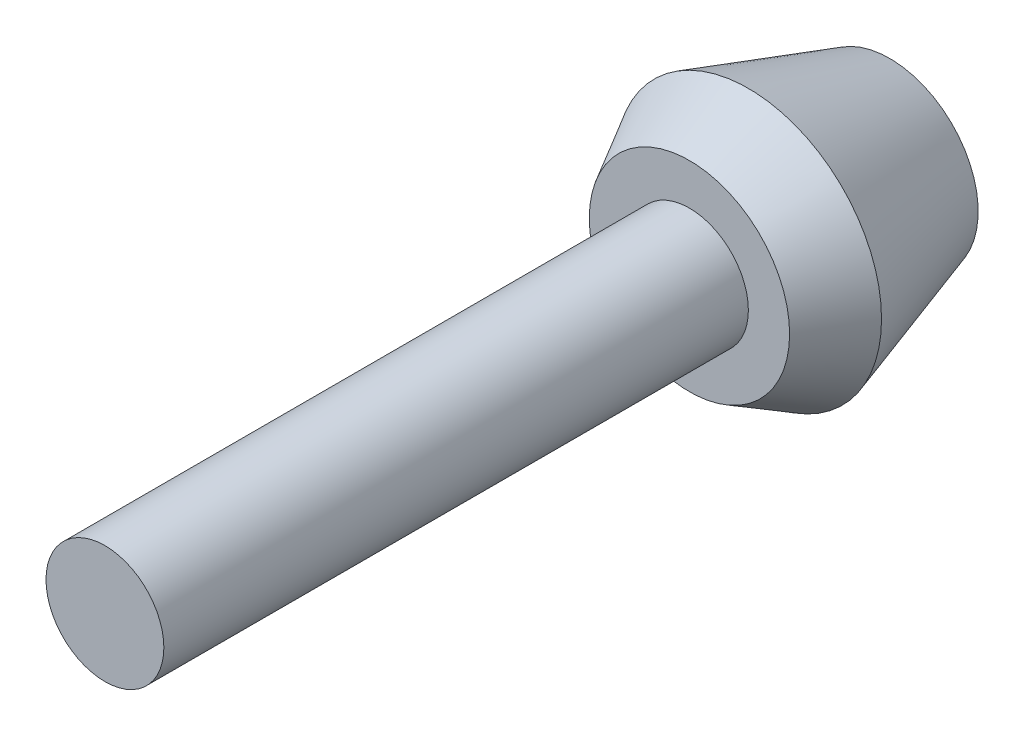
ISO-10303-21;
HEADER;
FILE_DESCRIPTION(('STEP AP214'),'2;1');
FILE_NAME('part.step','',(''),(''),'','','');
FILE_SCHEMA(('AUTOMOTIVE_DESIGN { 1 0 10303 214 1 1 1 1 }'));
ENDSEC;
DATA;
#1=APPLICATION_CONTEXT('core data for automotive mechanical design processes');
#2=APPLICATION_PROTOCOL_DEFINITION('international standard','automotive_design',2000,#1);
#3=PRODUCT_CONTEXT('',#1,'mechanical');
#4=PRODUCT('Part','Part','',(#3));
#5=PRODUCT_RELATED_PRODUCT_CATEGORY('part','',(#4));
#6=PRODUCT_DEFINITION_FORMATION('','',#4);
#7=PRODUCT_DEFINITION_CONTEXT('part definition',#1,'design');
#8=PRODUCT_DEFINITION('design','',#6,#7);
#9=PRODUCT_DEFINITION_SHAPE('','',#8);
#10=(LENGTH_UNIT() NAMED_UNIT(*) SI_UNIT(.MILLI.,.METRE.));
#11=(NAMED_UNIT(*) PLANE_ANGLE_UNIT() SI_UNIT($,.RADIAN.));
#12=(NAMED_UNIT(*) SI_UNIT($,.STERADIAN.) SOLID_ANGLE_UNIT());
#13=UNCERTAINTY_MEASURE_WITH_UNIT(LENGTH_MEASURE(1.E-05),#10,'distance_accuracy_value','');
#14=(GEOMETRIC_REPRESENTATION_CONTEXT(3) GLOBAL_UNCERTAINTY_ASSIGNED_CONTEXT((#13)) GLOBAL_UNIT_ASSIGNED_CONTEXT((#10,
#11,#12)) REPRESENTATION_CONTEXT('',''));
#15=CARTESIAN_POINT('',(0.,0.,0.));
#16=DIRECTION('',(0.,0.,1.));
#17=DIRECTION('',(1.,0.,0.));
#18=AXIS2_PLACEMENT_3D('',#15,#16,#17);
#19=CARTESIAN_POINT('',(0.,0.,0.));
#20=DIRECTION('',(0.,0.,-1.));
#21=DIRECTION('',(-1.,2.23741544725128E-13,0.));
#22=AXIS2_PLACEMENT_3D('',#19,#20,#21);
#23=PLANE('',#22);
#24=CARTESIAN_POINT('',(0.,0.,0.));
#25=DIRECTION('',(0.,0.,-1.));
#26=DIRECTION('',(-1.,0.,0.));
#27=AXIS2_PLACEMENT_3D('',#24,#25,#26);
#28=CIRCLE('',#27,3.75000000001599);
#29=CARTESIAN_POINT('',(-3.75000000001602,0.,0.));
#30=VERTEX_POINT('',#29);
#31=EDGE_CURVE('E33',#30,#30,#28,.F.);
#32=ORIENTED_EDGE('',*,*,#31,.F.);
#33=EDGE_LOOP('',(#32));
#34=FACE_BOUND('',#33,.T.);
#35=ADVANCED_FACE('F15',(#34),#23,.T.);
#36=CARTESIAN_POINT('',(0.,0.,5.79362678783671));
#37=DIRECTION('',(0.,0.,1.));
#38=DIRECTION('',(1.,-2.23741544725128E-13,0.));
#39=AXIS2_PLACEMENT_3D('',#36,#37,#38);
#40=CONICAL_SURFACE('',#39,5.58464848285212,0.306676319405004);
#41=ORIENTED_EDGE('',*,*,#31,.T.);
#42=EDGE_LOOP('',(#41));
#43=FACE_BOUND('',#42,.T.);
#44=CARTESIAN_POINT('',(0.,0.,5.99999999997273));
#45=DIRECTION('',(0.,0.,-1.));
#46=DIRECTION('',(-1.,0.,0.));
#47=AXIS2_PLACEMENT_3D('',#44,#45,#46);
#48=CIRCLE('',#47,5.65000000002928);
#49=CARTESIAN_POINT('',(-5.65000000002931,0.,5.99999999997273));
#50=VERTEX_POINT('',#49);
#51=EDGE_CURVE('E22',#50,#50,#48,.T.);
#52=ORIENTED_EDGE('',*,*,#51,.T.);
#53=EDGE_LOOP('',(#52));
#54=FACE_BOUND('',#53,.T.);
#55=ADVANCED_FACE('F54',(#43,#54),#40,.T.);
#56=CARTESIAN_POINT('',(0.,0.,6.18887432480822));
#57=DIRECTION('',(0.,0.,-1.));
#58=DIRECTION('',(-1.,2.23741544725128E-13,0.));
#59=AXIS2_PLACEMENT_3D('',#56,#57,#58);
#60=CONICAL_SURFACE('',#59,5.54423037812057,0.510488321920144);
#61=CARTESIAN_POINT('',(0.,0.,8.5));
#62=DIRECTION('',(0.,0.,-1.));
#63=DIRECTION('',(-1.,0.,0.));
#64=AXIS2_PLACEMENT_3D('',#61,#62,#63);
#65=CIRCLE('',#64,4.25000000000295);
#66=CARTESIAN_POINT('',(-4.25000000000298,0.,8.5));
#67=VERTEX_POINT('',#66);
#68=EDGE_CURVE('E10',#67,#67,#65,.F.);
#69=ORIENTED_EDGE('',*,*,#68,.F.);
#70=EDGE_LOOP('',(#69));
#71=FACE_BOUND('',#70,.T.);
#72=ORIENTED_EDGE('',*,*,#51,.F.);
#73=EDGE_LOOP('',(#72));
#74=FACE_BOUND('',#73,.T.);
#75=ADVANCED_FACE('F17',(#71,#74),#60,.T.);
#76=CARTESIAN_POINT('',(0.,0.,33.3));
#77=DIRECTION('',(0.,0.,-1.));
#78=DIRECTION('',(-1.,2.23741544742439E-13,0.));
#79=AXIS2_PLACEMENT_3D('',#76,#77,#78);
#80=PLANE('',#79);
#81=CARTESIAN_POINT('',(0.,0.,33.3));
#82=DIRECTION('',(0.,0.,-1.));
#83=DIRECTION('',(-1.,0.,0.));
#84=AXIS2_PLACEMENT_3D('',#81,#82,#83);
#85=CIRCLE('',#84,2.5);
#86=CARTESIAN_POINT('',(-2.50000000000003,0.,33.3));
#87=VERTEX_POINT('',#86);
#88=EDGE_CURVE('E26',#87,#87,#85,.T.);
#89=ORIENTED_EDGE('',*,*,#88,.F.);
#90=EDGE_LOOP('',(#89));
#91=FACE_BOUND('',#90,.T.);
#92=ADVANCED_FACE('F50',(#91),#80,.F.);
#93=CARTESIAN_POINT('',(0.,0.,2.));
#94=DIRECTION('',(0.,0.,1.));
#95=DIRECTION('',(1.,-2.23741544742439E-13,0.));
#96=AXIS2_PLACEMENT_3D('',#93,#94,#95);
#97=CYLINDRICAL_SURFACE('',#96,2.5);
#98=CARTESIAN_POINT('',(0.,0.,8.5));
#99=DIRECTION('',(0.,0.,1.));
#100=DIRECTION('',(1.,-2.23741544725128E-13,0.));
#101=AXIS2_PLACEMENT_3D('',#98,#99,#100);
#102=CIRCLE('',#101,2.5);
#103=CARTESIAN_POINT('',(2.49999999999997,-5.17720498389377E-13,8.5));
#104=VERTEX_POINT('',#103);
#105=EDGE_CURVE('E30',#104,#104,#102,.T.);
#106=ORIENTED_EDGE('',*,*,#105,.T.);
#107=EDGE_LOOP('',(#106));
#108=FACE_BOUND('',#107,.T.);
#109=ORIENTED_EDGE('',*,*,#88,.T.);
#110=EDGE_LOOP('',(#109));
#111=FACE_BOUND('',#110,.T.);
#112=ADVANCED_FACE('F39',(#108,#111),#97,.T.);
#113=CARTESIAN_POINT('',(0.,0.,8.5));
#114=DIRECTION('',(0.,0.,-1.));
#115=DIRECTION('',(-1.,2.23741544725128E-13,0.));
#116=AXIS2_PLACEMENT_3D('',#113,#114,#115);
#117=PLANE('',#116);
#118=ORIENTED_EDGE('',*,*,#105,.F.);
#119=EDGE_LOOP('',(#118));
#120=FACE_BOUND('',#119,.T.);
#121=ORIENTED_EDGE('',*,*,#68,.T.);
#122=EDGE_LOOP('',(#121));
#123=FACE_BOUND('',#122,.T.);
#124=ADVANCED_FACE('F42',(#120,#123),#117,.F.);
#125=CLOSED_SHELL('',(#35,#55,#75,#92,#112,#124));
#126=MANIFOLD_SOLID_BREP('B1',#125);
#127=ADVANCED_BREP_SHAPE_REPRESENTATION('',(#18,#126),#14);
#128=SHAPE_DEFINITION_REPRESENTATION(#9,#127);
ENDSEC;
END-ISO-10303-21;
